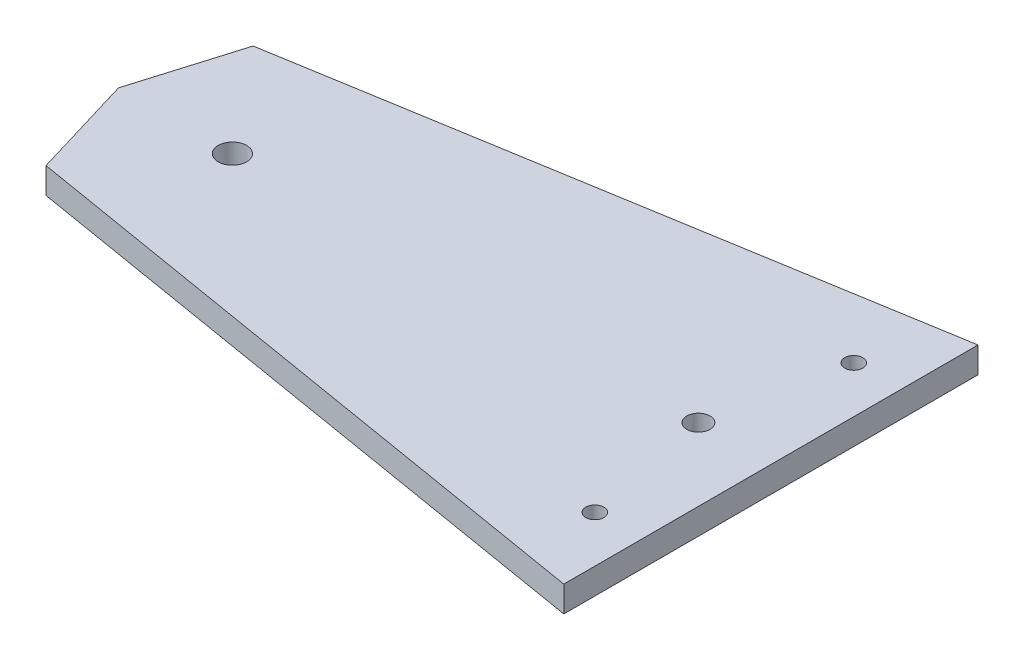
from build123d import *

# Parameters (mm, degrees)
SKETCH1_R           = 2.75
SKETCH1_R_2         = 2.25
SKETCH1_R_3         = 1.75
BOSS_EXTRUDE1_DEPTH = 5


with BuildPart() as part:
    # Sketch1 → Boss-Extrude1 (new body)
    with BuildSketch(Plane(origin=(0, 0, 0), x_dir=(1, 0, 0), z_dir=(0, 1, 0))):
        Polygon((126, -40), (126, 40), (6, 20), (0, 0), (6, -20), align=None)
        with Locations(Location((22, 0, 0), (0, 0, 270))):
            Circle(SKETCH1_R, mode=Mode.SUBTRACT)
        with Locations(Location((112, 0, 0), (0, 0, 270))):
            Circle(SKETCH1_R_2, mode=Mode.SUBTRACT)
        with Locations(Location((117, 25, 0), (0, 0, 270))):
            Circle(SKETCH1_R_3, mode=Mode.SUBTRACT)
        with Locations(Location((117, -25, 0), (0, 0, 90))):
            Circle(SKETCH1_R_3, mode=Mode.SUBTRACT)
    extrude(amount=-BOSS_EXTRUDE1_DEPTH)


solid = part.part
